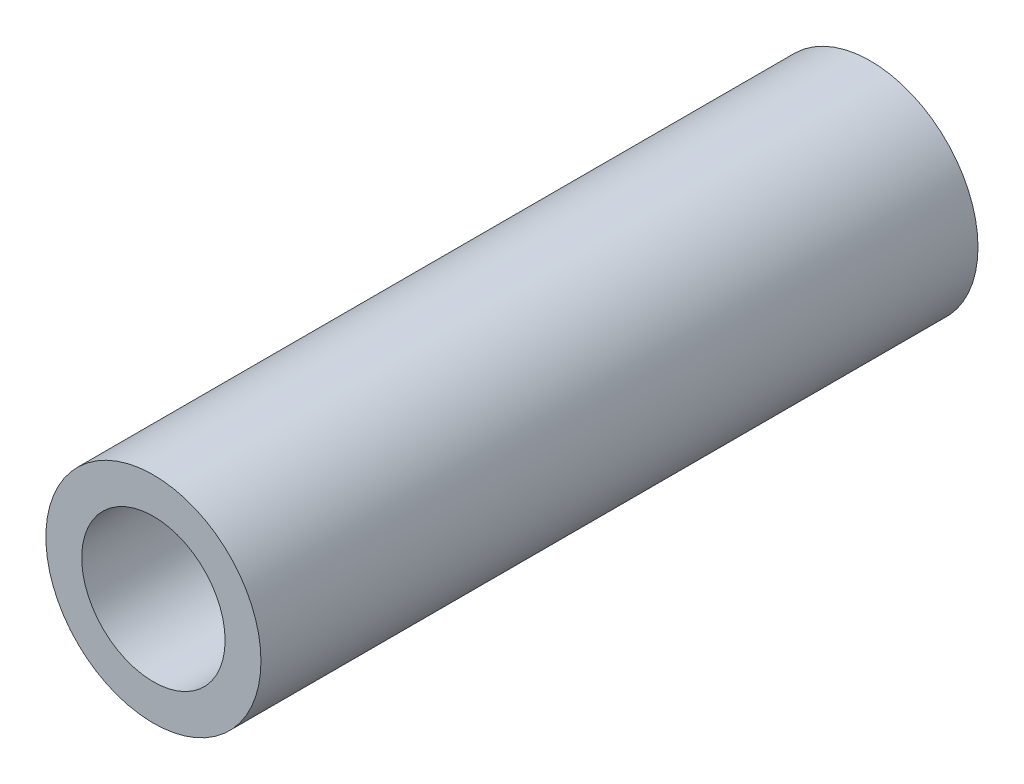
ISO-10303-21;
HEADER;
FILE_DESCRIPTION(('STEP AP214'),'2;1');
FILE_NAME('part.step','',(''),(''),'','','');
FILE_SCHEMA(('AUTOMOTIVE_DESIGN { 1 0 10303 214 1 1 1 1 }'));
ENDSEC;
DATA;
#1=APPLICATION_CONTEXT('core data for automotive mechanical design processes');
#2=APPLICATION_PROTOCOL_DEFINITION('international standard','automotive_design',2000,#1);
#3=PRODUCT_CONTEXT('',#1,'mechanical');
#4=PRODUCT('Part','Part','',(#3));
#5=PRODUCT_RELATED_PRODUCT_CATEGORY('part','',(#4));
#6=PRODUCT_DEFINITION_FORMATION('','',#4);
#7=PRODUCT_DEFINITION_CONTEXT('part definition',#1,'design');
#8=PRODUCT_DEFINITION('design','',#6,#7);
#9=PRODUCT_DEFINITION_SHAPE('','',#8);
#10=(LENGTH_UNIT() NAMED_UNIT(*) SI_UNIT(.MILLI.,.METRE.));
#11=(NAMED_UNIT(*) PLANE_ANGLE_UNIT() SI_UNIT($,.RADIAN.));
#12=(NAMED_UNIT(*) SI_UNIT($,.STERADIAN.) SOLID_ANGLE_UNIT());
#13=UNCERTAINTY_MEASURE_WITH_UNIT(LENGTH_MEASURE(1.E-05),#10,'distance_accuracy_value','');
#14=(GEOMETRIC_REPRESENTATION_CONTEXT(3) GLOBAL_UNCERTAINTY_ASSIGNED_CONTEXT((#13)) GLOBAL_UNIT_ASSIGNED_CONTEXT((#10,
#11,#12)) REPRESENTATION_CONTEXT('',''));
#15=CARTESIAN_POINT('',(0.,0.,0.));
#16=DIRECTION('',(0.,0.,1.));
#17=DIRECTION('',(1.,0.,0.));
#18=AXIS2_PLACEMENT_3D('',#15,#16,#17);
#19=CARTESIAN_POINT('',(0.,0.,50.));
#20=DIRECTION('',(0.,0.,1.));
#21=DIRECTION('',(1.,0.,0.));
#22=AXIS2_PLACEMENT_3D('',#19,#20,#21);
#23=PLANE('',#22);
#24=CARTESIAN_POINT('',(0.,0.,50.));
#25=DIRECTION('',(0.,0.,1.));
#26=DIRECTION('',(1.,0.,0.));
#27=AXIS2_PLACEMENT_3D('',#24,#25,#26);
#28=CIRCLE('',#27,7.5);
#29=CARTESIAN_POINT('',(7.5,0.,50.));
#30=VERTEX_POINT('',#29);
#31=EDGE_CURVE('E10',#30,#30,#28,.T.);
#32=ORIENTED_EDGE('',*,*,#31,.T.);
#33=EDGE_LOOP('',(#32));
#34=FACE_BOUND('',#33,.T.);
#35=CARTESIAN_POINT('',(0.,0.,50.));
#36=DIRECTION('',(0.,0.,1.));
#37=DIRECTION('',(1.,0.,0.));
#38=AXIS2_PLACEMENT_3D('',#35,#36,#37);
#39=CIRCLE('',#38,5.);
#40=CARTESIAN_POINT('',(5.,0.,50.));
#41=VERTEX_POINT('',#40);
#42=EDGE_CURVE('E41',#41,#41,#39,.T.);
#43=ORIENTED_EDGE('',*,*,#42,.F.);
#44=EDGE_LOOP('',(#43));
#45=FACE_BOUND('',#44,.T.);
#46=ADVANCED_FACE('F30',(#34,#45),#23,.T.);
#47=CARTESIAN_POINT('',(0.,0.,0.));
#48=DIRECTION('',(0.,0.,1.));
#49=DIRECTION('',(1.,0.,0.));
#50=AXIS2_PLACEMENT_3D('',#47,#48,#49);
#51=PLANE('',#50);
#52=CARTESIAN_POINT('',(0.,0.,0.));
#53=DIRECTION('',(0.,0.,1.));
#54=DIRECTION('',(1.,0.,0.));
#55=AXIS2_PLACEMENT_3D('',#52,#53,#54);
#56=CIRCLE('',#55,7.5);
#57=CARTESIAN_POINT('',(7.5,0.,0.));
#58=VERTEX_POINT('',#57);
#59=EDGE_CURVE('E34',#58,#58,#56,.T.);
#60=ORIENTED_EDGE('',*,*,#59,.F.);
#61=EDGE_LOOP('',(#60));
#62=FACE_BOUND('',#61,.T.);
#63=CARTESIAN_POINT('',(0.,0.,0.));
#64=DIRECTION('',(0.,0.,1.));
#65=DIRECTION('',(1.,0.,0.));
#66=AXIS2_PLACEMENT_3D('',#63,#64,#65);
#67=CIRCLE('',#66,5.);
#68=CARTESIAN_POINT('',(5.,0.,0.));
#69=VERTEX_POINT('',#68);
#70=EDGE_CURVE('E43',#69,#69,#67,.T.);
#71=ORIENTED_EDGE('',*,*,#70,.T.);
#72=EDGE_LOOP('',(#71));
#73=FACE_BOUND('',#72,.T.);
#74=ADVANCED_FACE('F53',(#62,#73),#51,.F.);
#75=CARTESIAN_POINT('',(0.,0.,50.));
#76=DIRECTION('',(0.,0.,-1.));
#77=DIRECTION('',(-1.,0.,0.));
#78=AXIS2_PLACEMENT_3D('',#75,#76,#77);
#79=CYLINDRICAL_SURFACE('',#78,7.5);
#80=ORIENTED_EDGE('',*,*,#31,.F.);
#81=EDGE_LOOP('',(#80));
#82=FACE_BOUND('',#81,.T.);
#83=ORIENTED_EDGE('',*,*,#59,.T.);
#84=EDGE_LOOP('',(#83));
#85=FACE_BOUND('',#84,.T.);
#86=ADVANCED_FACE('F32',(#82,#85),#79,.T.);
#87=CARTESIAN_POINT('',(0.,0.,50.));
#88=DIRECTION('',(0.,0.,-1.));
#89=DIRECTION('',(-1.,0.,0.));
#90=AXIS2_PLACEMENT_3D('',#87,#88,#89);
#91=CYLINDRICAL_SURFACE('',#90,5.);
#92=ORIENTED_EDGE('',*,*,#42,.T.);
#93=EDGE_LOOP('',(#92));
#94=FACE_BOUND('',#93,.T.);
#95=ORIENTED_EDGE('',*,*,#70,.F.);
#96=EDGE_LOOP('',(#95));
#97=FACE_BOUND('',#96,.T.);
#98=ADVANCED_FACE('F49',(#94,#97),#91,.F.);
#99=CLOSED_SHELL('',(#46,#74,#86,#98));
#100=MANIFOLD_SOLID_BREP('B2',#99);
#101=ADVANCED_BREP_SHAPE_REPRESENTATION('',(#18,#100),#14);
#102=SHAPE_DEFINITION_REPRESENTATION(#9,#101);
ENDSEC;
END-ISO-10303-21;
